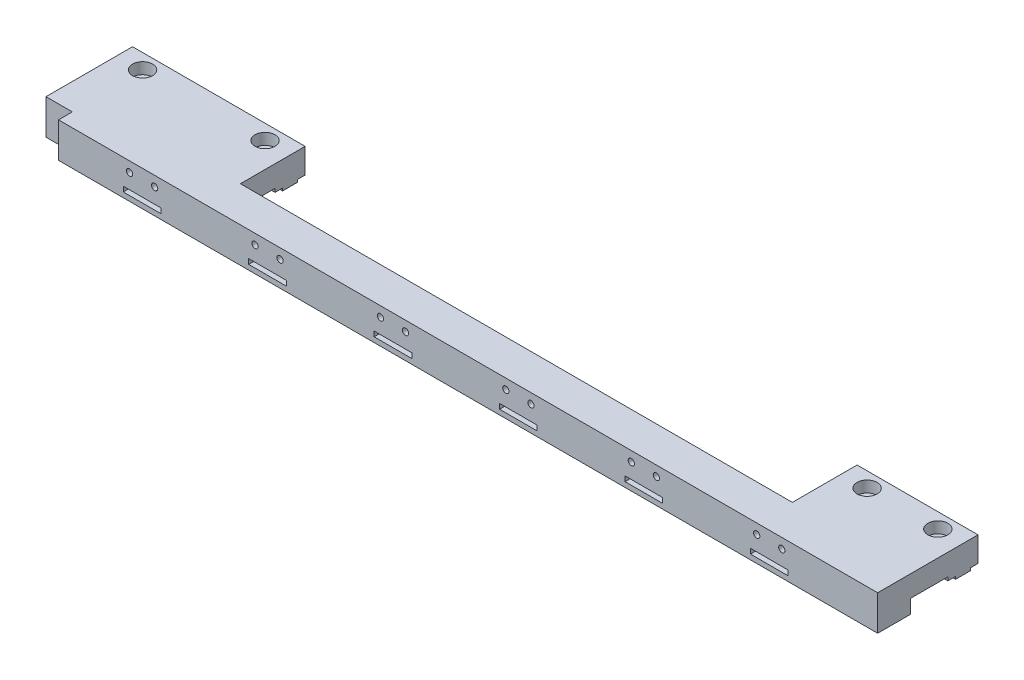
from build123d import *

# Parameters (mm, degrees)
SKETCH_1_W          = 337
SKETCH_1_H          = 14
EXTRUDE_1_DEPTH     = 40
SKETCH_2_W          = 15
SKETCH_2_H          = 2
CUT_EXTRUDE_1_DEPTH = 40
SKETCH_3_R          = 1.25
CUT_EXTRUDE_2_DEPTH = 15
SKETCH_4_OUTSIDE_W  = 109.93
SKETCH_4_OUTSIDE_H  = 83.93
CUT_EXTRUDE_3_DEPTH = 340.654235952
SKETCH_5_OUTSIDE_W  = 406.93
SKETCH_5_OUTSIDE_H  = 109.93
SKETCH_5_OUTSIDE_R  = 2.25
CUT_EXTRUDE_4_DEPTH = 340.654235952
SKETCH_6_R          = 4
CUT_EXTRUDE_5_DEPTH = 4.5


with BuildPart() as part:
    # Sketch 1 → Extrude 1 (new body)
    with BuildSketch(Plane.XY):
        with Locations((168.5, 7)):
            Rectangle(SKETCH_1_W, SKETCH_1_H)
    extrude(amount=EXTRUDE_1_DEPTH)

    # Sketch 2 → Cut-Extrude 1 (cut)
    with BuildSketch(Plane.XY.offset(40)):
        with Locations((43.8, 3)):
            Rectangle(SKETCH_2_W, SKETCH_2_H)
        with Locations((93.8, 3)):
            Rectangle(SKETCH_2_W, SKETCH_2_H)
        with Locations((143.8, 3)):
            Rectangle(SKETCH_2_W, SKETCH_2_H)
        with Locations((193.8, 3)):
            Rectangle(SKETCH_2_W, SKETCH_2_H)
        with Locations((243.8, 3)):
            Rectangle(SKETCH_2_W, SKETCH_2_H)
        with Locations((293.8, 3)):
            Rectangle(SKETCH_2_W, SKETCH_2_H)
    extrude(amount=-CUT_EXTRUDE_1_DEPTH, mode=Mode.SUBTRACT)

    # Sketch 3 → Cut-Extrude 2 (cut)
    with BuildSketch(Plane.XY.offset(40)):
        with Locations((38.8, 10)):
            Circle(SKETCH_3_R)
        with Locations((48.8, 10)):
            Circle(SKETCH_3_R)
        with Locations((88.8, 10)):
            Circle(SKETCH_3_R)
        with Locations((98.8, 10)):
            Circle(SKETCH_3_R)
        with Locations((138.8, 10)):
            Circle(SKETCH_3_R)
        with Locations((148.8, 10)):
            Circle(SKETCH_3_R)
        with Locations((188.8, 10)):
            Circle(SKETCH_3_R)
        with Locations((198.8, 10)):
            Circle(SKETCH_3_R)
        with Locations((238.8, 10)):
            Circle(SKETCH_3_R)
        with Locations((248.8, 10)):
            Circle(SKETCH_3_R)
        with Locations((288.8, 10)):
            Circle(SKETCH_3_R)
        with Locations((298.8, 10)):
            Circle(SKETCH_3_R)
    extrude(amount=-CUT_EXTRUDE_2_DEPTH, mode=Mode.SUBTRACT)

    # Sketch 4 outside → Cut-Extrude 3 (cut, through all)
    with BuildSketch(Plane(origin=(337, 0, 0), x_dir=(0, 0, -1), z_dir=(1, 0, 0))):
        with Locations((-20, 7)):
            Rectangle(SKETCH_4_OUTSIDE_W, SKETCH_4_OUTSIDE_H)
        Polygon((-3, 3.1), (-3, 4.1), (0, 4.1), (0, 14), (-40, 14), (-40, 0), (-27, 0), (-27, 5.5), (-12, 5.5), (-12, 4.1), (-9, 4.1), (-9, 3.1), align=None, mode=Mode.SUBTRACT)
    extrude(amount=-CUT_EXTRUDE_3_DEPTH, mode=Mode.SUBTRACT)

    # Sketch 5 outside → Cut-Extrude 4 (cut, through all)
    # profile 1 of 5: a face of its own
    with BuildSketch(Plane(origin=(0, 14, 0), x_dir=(1, 0, 0), z_dir=(0, 1, 0))):
        with Locations((168.5, -20)):
            Rectangle(SKETCH_5_OUTSIDE_W, SKETCH_5_OUTSIDE_H)
        Polygon((0, 0), (68.8, 0), (68.8, -25.8), (288.8, -25.8), (288.8, 0), (337, 0), (337, -40), (10.5, -40), (10.5, -34.5), (0, -34.5), align=None, mode=Mode.SUBTRACT)
    # profile 2 of 5: a face of its own
    with BuildSketch(Plane(origin=(0, 14, 0), x_dir=(1, 0, 0), z_dir=(0, 1, 0))):
        with Locations(Location((298.8, -6, 0), (0, 0, 270))):
            Circle(SKETCH_5_OUTSIDE_R)
    # profile 3 of 5: a face of its own
    with BuildSketch(Plane(origin=(0, 14, 0), x_dir=(1, 0, 0), z_dir=(0, 1, 0))):
        with Locations(Location((327, -6, 0), (0, 0, 270))):
            Circle(SKETCH_5_OUTSIDE_R)
    # profile 4 of 5: a face of its own
    with BuildSketch(Plane(origin=(0, 14, 0), x_dir=(1, 0, 0), z_dir=(0, 1, 0))):
        with Locations(Location((10, -6, 0), (0, 0, 270))):
            Circle(SKETCH_5_OUTSIDE_R)
    # profile 5 of 5: a face of its own
    with BuildSketch(Plane(origin=(0, 14, 0), x_dir=(1, 0, 0), z_dir=(0, 1, 0))):
        with Locations(Location((58.8, -6, 0), (0, 0, 270))):
            Circle(SKETCH_5_OUTSIDE_R)
    extrude(amount=-CUT_EXTRUDE_4_DEPTH, mode=Mode.SUBTRACT)

    # Sketch 6 → Cut-Extrude 5 (cut)
    with BuildSketch(Plane(origin=(0, 14, 0), x_dir=(1, 0, 0), z_dir=(0, 1, 0))):
        with Locations(Location((298.8, -6, 0), (0, 0, 270))):
            Circle(SKETCH_6_R)
        with Locations(Location((327, -6, 0), (0, 0, 270))):
            Circle(SKETCH_6_R)
        with Locations(Location((10, -6, 0), (0, 0, 270))):
            Circle(SKETCH_6_R)
        with Locations(Location((58.8, -6, 0), (0, 0, 270))):
            Circle(SKETCH_6_R)
    extrude(amount=-CUT_EXTRUDE_5_DEPTH, mode=Mode.SUBTRACT)


solid = part.part
